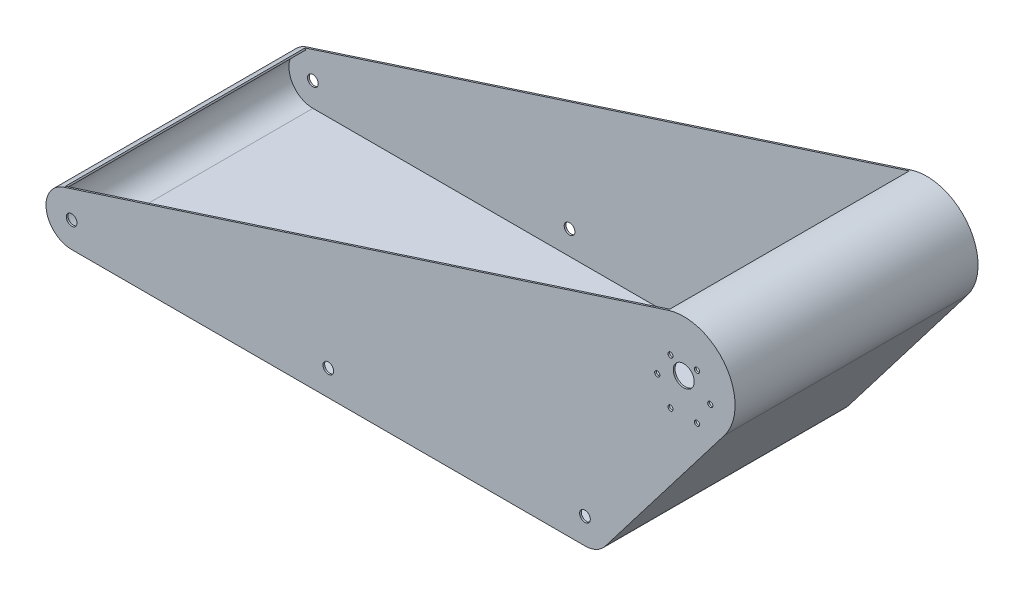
from build123d import *

# Parameters (mm, degrees)
BOSS_EXTRUDE1_DEPTH = 1
BOSS_EXTRUDE2_DEPTH = 140
BOSS_EXTRUDE3_DEPTH = 1
CUT_EXTRUDE2_REACH  = 434.921
SKETCH4_R           = 3.125
SKETCH4_R_2         = 6.125


with BuildPart() as part:
    # Sketch1 → Boss-Extrude1 (new body)
    with BuildSketch(Plane.XY):
        with BuildLine():
            Line((0, -15), (300, -15))
            ThreePointArc((300, -15), (306.63878091, -13.450895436), (311.906339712, -9.123545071))
            Line((311.906339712, -9.123545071), (381.562679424, 81.778843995))
            ThreePointArc((381.562679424, 81.778843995), (382.253325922, 117.334516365), (348.511821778, 128.568114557))
            Line((348.511821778, 128.568114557), (-4.619089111, 14.27109021))
            ThreePointArc((-4.619089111, 14.27109021), (-14.816652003, -2.338123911), (0, -15))
        make_face()
    extrude(amount=BOSS_EXTRUDE1_DEPTH)

    # Sketch2 → Boss-Extrude2 (add)
    with BuildSketch(Plane.XY.offset(1)):
        with BuildLine():
            Line((-4.619089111, 14.27109021), (-4.311149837, 13.319684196))
            ThreePointArc((-4.311149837, 13.319684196), (-13.828875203, -2.182248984), (0, -14))
            Line((0, -14), (300, -14))
            ThreePointArc((300, -14), (306.196195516, -12.554169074), (311.112583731, -8.515308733))
            Line((311.112583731, -8.515308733), (380.768923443, 82.387080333))
            ThreePointArc((380.768923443, 82.387080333), (381.436548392, 116.757563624), (348.819761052, 127.616708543))
            Line((348.819761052, 127.616708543), (348.511821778, 128.568114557))
            ThreePointArc((348.511821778, 128.568114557), (382.253325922, 117.334516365), (381.562679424, 81.778843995))
            Line((381.562679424, 81.778843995), (311.906339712, -9.123545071))
            ThreePointArc((311.906339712, -9.123545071), (306.63878091, -13.450895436), (300, -15))
            Line((300, -15), (0, -15))
            ThreePointArc((0, -15), (-14.816652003, -2.338123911), (-4.619089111, 14.27109021))
        make_face()
    extrude(amount=BOSS_EXTRUDE2_DEPTH)

    # Sketch3 → Boss-Extrude3 (add)
    with BuildSketch(Plane.XY.offset(141)):
        with BuildLine():
            Line((311.906339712, -9.123545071), (381.562679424, 81.778843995))
            ThreePointArc((381.562679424, 81.778843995), (382.253325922, 117.334516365), (348.511821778, 128.568114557))
            Line((348.511821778, 128.568114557), (-4.619089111, 14.27109021))
            ThreePointArc((-4.619089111, 14.27109021), (-14.816652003, -2.338123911), (0, -15))
            Line((0, -15), (300, -15))
            ThreePointArc((300, -15), (306.63878091, -13.450895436), (311.906339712, -9.123545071))
        make_face()
    extrude(amount=BOSS_EXTRUDE3_DEPTH)

    # Cut-Extrude2: up to this face of the body (flat: up to its plane)
    cut_extrude2_end = Plane(part.part.faces().sort_by_distance((216.461417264, 39.727519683, 0))[0])
    # Sketch4 → Cut-Extrude2 (cut, up to the picked face)
    with BuildSketch(Plane.XY.offset(142), mode=Mode.PRIVATE) as cut_extrude2_sk1:
        Circle(SKETCH4_R)
    cut_extrude2_tool1 = split(extrude(cut_extrude2_sk1.sketch, amount=-CUT_EXTRUDE2_REACH, mode=Mode.PRIVATE), bisect_by=cut_extrude2_end, keep=Keep.BOTH, mode=Mode.PRIVATE)
    # Sketch4 → Cut-Extrude2 (cut, up to the picked face)
    with BuildSketch(Plane.XY.offset(142), mode=Mode.PRIVATE) as cut_extrude2_sk2:
        with Locations((300, 0)):
            Circle(SKETCH4_R)
    cut_extrude2_tool2 = split(extrude(cut_extrude2_sk2.sketch, amount=-CUT_EXTRUDE2_REACH, mode=Mode.PRIVATE), bisect_by=cut_extrude2_end, keep=Keep.BOTH, mode=Mode.PRIVATE)
    # Sketch4 → Cut-Extrude2 (cut, up to the picked face)
    with BuildSketch(Plane.XY.offset(142), mode=Mode.PRIVATE) as cut_extrude2_sk3:
        with Locations((357.75, 100.025934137)):
            Circle(SKETCH4_R_2)
    cut_extrude2_tool3 = split(extrude(cut_extrude2_sk3.sketch, amount=-CUT_EXTRUDE2_REACH, mode=Mode.PRIVATE), bisect_by=cut_extrude2_end, keep=Keep.BOTH, mode=Mode.PRIVATE)
    # Sketch4 → Cut-Extrude2 (cut, up to the picked face)
    with BuildSketch(Plane.XY.offset(142), mode=Mode.PRIVATE) as cut_extrude2_sk4:
        with Locations((150, 0)):
            Circle(SKETCH4_R)
    cut_extrude2_tool4 = split(extrude(cut_extrude2_sk4.sketch, amount=-CUT_EXTRUDE2_REACH, mode=Mode.PRIVATE), bisect_by=cut_extrude2_end, keep=Keep.BOTH, mode=Mode.PRIVATE)
    # Sketch4 → Cut-Extrude2 (cut, up to the picked face)
    with BuildSketch(Plane.XY.offset(142), mode=Mode.PRIVATE) as cut_extrude2_sk5:
        with BuildLine():
            ThreePointArc((367, 106.666802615), (365.5, 108.166802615), (364, 106.666802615))
            ThreePointArc((364, 106.666802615), (365.5, 105.166802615), (367, 106.666802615))
        make_face()
    cut_extrude2_tool5 = split(extrude(cut_extrude2_sk5.sketch, amount=-CUT_EXTRUDE2_REACH, mode=Mode.PRIVATE), bisect_by=cut_extrude2_end, keep=Keep.BOTH, mode=Mode.PRIVATE)
    # Sketch4 → Cut-Extrude2 (cut, up to the picked face)
    with BuildSketch(Plane.XY.offset(142), mode=Mode.PRIVATE) as cut_extrude2_sk6:
        with BuildLine():
            ThreePointArc((374.75, 93.243408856), (373.25, 94.743408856), (371.75, 93.243408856))
            ThreePointArc((371.75, 93.243408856), (373.25, 91.743408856), (374.75, 93.243408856))
        make_face()
    cut_extrude2_tool6 = split(extrude(cut_extrude2_sk6.sketch, amount=-CUT_EXTRUDE2_REACH, mode=Mode.PRIVATE), bisect_by=cut_extrude2_end, keep=Keep.BOTH, mode=Mode.PRIVATE)
    # Sketch4 → Cut-Extrude2 (cut, up to the picked face)
    with BuildSketch(Plane.XY.offset(142), mode=Mode.PRIVATE) as cut_extrude2_sk7:
        with BuildLine():
            ThreePointArc((367, 79.820015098), (365.5, 81.320015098), (364, 79.820015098))
            ThreePointArc((364, 79.820015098), (365.5, 78.320015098), (367, 79.820015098))
        make_face()
    cut_extrude2_tool7 = split(extrude(cut_extrude2_sk7.sketch, amount=-CUT_EXTRUDE2_REACH, mode=Mode.PRIVATE), bisect_by=cut_extrude2_end, keep=Keep.BOTH, mode=Mode.PRIVATE)
    # Sketch4 → Cut-Extrude2 (cut, up to the picked face)
    with BuildSketch(Plane.XY.offset(142), mode=Mode.PRIVATE) as cut_extrude2_sk8:
        with BuildLine():
            ThreePointArc((351.5, 79.820015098), (350, 81.320015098), (348.5, 79.820015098))
            ThreePointArc((348.5, 79.820015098), (350, 78.320015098), (351.5, 79.820015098))
        make_face()
    cut_extrude2_tool8 = split(extrude(cut_extrude2_sk8.sketch, amount=-CUT_EXTRUDE2_REACH, mode=Mode.PRIVATE), bisect_by=cut_extrude2_end, keep=Keep.BOTH, mode=Mode.PRIVATE)
    # Sketch4 → Cut-Extrude2 (cut, up to the picked face)
    with BuildSketch(Plane.XY.offset(142), mode=Mode.PRIVATE) as cut_extrude2_sk9:
        with BuildLine():
            ThreePointArc((343.75, 93.243408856), (342.25, 94.743408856), (340.75, 93.243408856))
            ThreePointArc((340.75, 93.243408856), (342.25, 91.743408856), (343.75, 93.243408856))
        make_face()
    cut_extrude2_tool9 = split(extrude(cut_extrude2_sk9.sketch, amount=-CUT_EXTRUDE2_REACH, mode=Mode.PRIVATE), bisect_by=cut_extrude2_end, keep=Keep.BOTH, mode=Mode.PRIVATE)
    # Sketch4 → Cut-Extrude2 (cut, up to the picked face)
    with BuildSketch(Plane.XY.offset(142), mode=Mode.PRIVATE) as cut_extrude2_sk10:
        with BuildLine():
            ThreePointArc((351.5, 106.666802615), (350, 108.166802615), (348.5, 106.666802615))
            ThreePointArc((348.5, 106.666802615), (350, 105.166802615), (351.5, 106.666802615))
        make_face()
    cut_extrude2_tool10 = split(extrude(cut_extrude2_sk10.sketch, amount=-CUT_EXTRUDE2_REACH, mode=Mode.PRIVATE), bisect_by=cut_extrude2_end, keep=Keep.BOTH, mode=Mode.PRIVATE)
    add(cut_extrude2_tool1.solids().sort_by(Axis((0, 0, 142), (0, 0, -1)))[0], mode=Mode.SUBTRACT)
    add(cut_extrude2_tool2.solids().sort_by(Axis((300, 0, 142), (0, 0, -1)))[0], mode=Mode.SUBTRACT)
    add(cut_extrude2_tool3.solids().sort_by(Axis((357.75, 100.025934, 142), (0, 0, -1)))[0], mode=Mode.SUBTRACT)
    add(cut_extrude2_tool4.solids().sort_by(Axis((150, 0, 142), (0, 0, -1)))[0], mode=Mode.SUBTRACT)
    add(cut_extrude2_tool5.solids().sort_by(Axis((365.5, 106.666803, 142), (0, 0, -1)))[0], mode=Mode.SUBTRACT)
    add(cut_extrude2_tool6.solids().sort_by(Axis((373.25, 93.243409, 142), (0, 0, -1)))[0], mode=Mode.SUBTRACT)
    add(cut_extrude2_tool7.solids().sort_by(Axis((365.5, 79.820015, 142), (0, 0, -1)))[0], mode=Mode.SUBTRACT)
    add(cut_extrude2_tool8.solids().sort_by(Axis((350, 79.820015, 142), (0, 0, -1)))[0], mode=Mode.SUBTRACT)
    add(cut_extrude2_tool9.solids().sort_by(Axis((342.25, 93.243409, 142), (0, 0, -1)))[0], mode=Mode.SUBTRACT)
    add(cut_extrude2_tool10.solids().sort_by(Axis((350, 106.666803, 142), (0, 0, -1)))[0], mode=Mode.SUBTRACT)


solid = part.part
